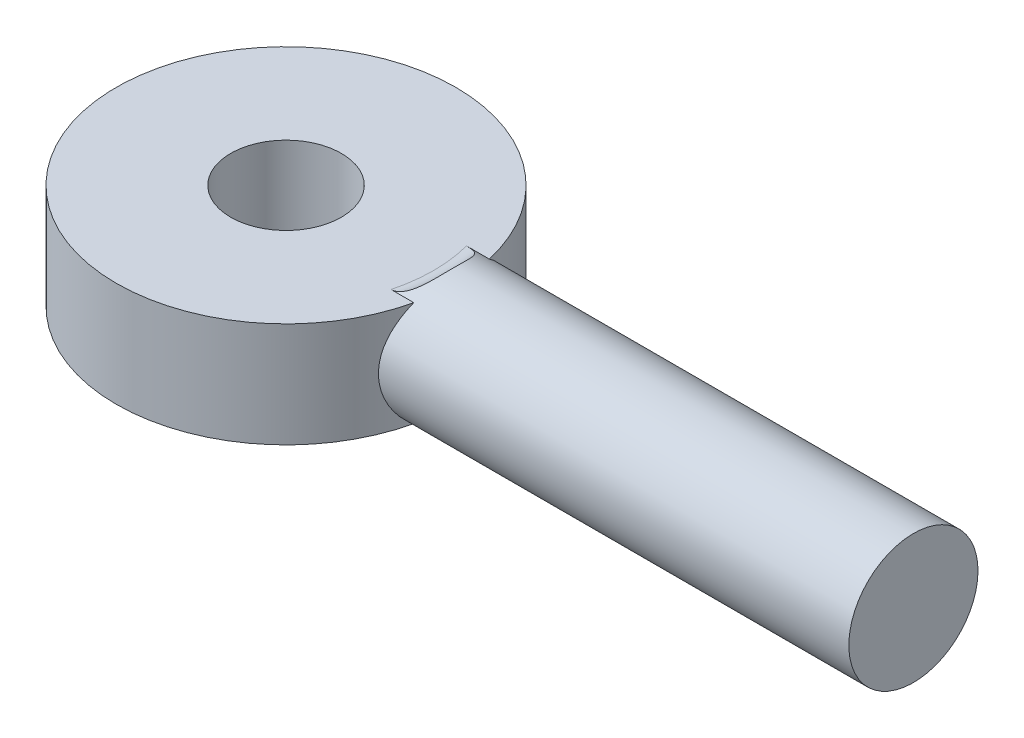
ISO-10303-21;
HEADER;
FILE_DESCRIPTION(('STEP AP214'),'2;1');
FILE_NAME('part.step','',(''),(''),'','','');
FILE_SCHEMA(('AUTOMOTIVE_DESIGN { 1 0 10303 214 1 1 1 1 }'));
ENDSEC;
DATA;
#1=APPLICATION_CONTEXT('core data for automotive mechanical design processes');
#2=APPLICATION_PROTOCOL_DEFINITION('international standard','automotive_design',2000,#1);
#3=PRODUCT_CONTEXT('',#1,'mechanical');
#4=PRODUCT('Part','Part','',(#3));
#5=PRODUCT_RELATED_PRODUCT_CATEGORY('part','',(#4));
#6=PRODUCT_DEFINITION_FORMATION('','',#4);
#7=PRODUCT_DEFINITION_CONTEXT('part definition',#1,'design');
#8=PRODUCT_DEFINITION('design','',#6,#7);
#9=PRODUCT_DEFINITION_SHAPE('','',#8);
#10=(LENGTH_UNIT() NAMED_UNIT(*) SI_UNIT(.MILLI.,.METRE.));
#11=(NAMED_UNIT(*) PLANE_ANGLE_UNIT() SI_UNIT($,.RADIAN.));
#12=(NAMED_UNIT(*) SI_UNIT($,.STERADIAN.) SOLID_ANGLE_UNIT());
#13=UNCERTAINTY_MEASURE_WITH_UNIT(LENGTH_MEASURE(1.E-05),#10,'distance_accuracy_value','');
#14=(GEOMETRIC_REPRESENTATION_CONTEXT(3) GLOBAL_UNCERTAINTY_ASSIGNED_CONTEXT((#13)) GLOBAL_UNIT_ASSIGNED_CONTEXT((#10,
#11,#12)) REPRESENTATION_CONTEXT('',''));
#15=CARTESIAN_POINT('',(0.,0.,0.));
#16=DIRECTION('',(0.,0.,1.));
#17=DIRECTION('',(1.,0.,0.));
#18=AXIS2_PLACEMENT_3D('',#15,#16,#17);
#19=CARTESIAN_POINT('',(0.,4.5085,0.));
#20=DIRECTION('',(0.,1.,0.));
#21=DIRECTION('',(0.,0.,1.));
#22=AXIS2_PLACEMENT_3D('',#19,#20,#21);
#23=PLANE('',#22);
#24=CARTESIAN_POINT('',(0.,4.5085,0.));
#25=DIRECTION('',(0.,1.,0.));
#26=DIRECTION('',(0.,0.,1.));
#27=AXIS2_PLACEMENT_3D('',#24,#25,#26);
#28=CIRCLE('',#27,12.7);
#29=CARTESIAN_POINT('',(12.2778116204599,4.5085,3.24735920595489));
#30=VERTEX_POINT('',#29);
#31=CARTESIAN_POINT('',(12.2778116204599,4.5085,-3.24735920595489));
#32=VERTEX_POINT('',#31);
#33=EDGE_CURVE('E89',#30,#32,#28,.T.);
#34=ORIENTED_EDGE('',*,*,#33,.T.);
#35=DIRECTION('',(1.,0.,0.));
#36=VECTOR('',#35,1.);
#37=CARTESIAN_POINT('',(12.2778116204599,4.5085,-3.24735920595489));
#38=LINE('',#37,#36);
#39=CARTESIAN_POINT('',(14.2394059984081,4.5085,-3.24735920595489));
#40=VERTEX_POINT('',#39);
#41=EDGE_CURVE('E91',#32,#40,#38,.T.);
#42=ORIENTED_EDGE('',*,*,#41,.T.);
#43=CARTESIAN_POINT('',(0.,4.5085,0.));
#44=DIRECTION('',(0.,1.,0.));
#45=DIRECTION('',(0.,0.,1.));
#46=AXIS2_PLACEMENT_3D('',#43,#44,#45);
#47=CIRCLE('',#46,14.605);
#48=CARTESIAN_POINT('',(14.2394059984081,4.5085,3.24735920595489));
#49=VERTEX_POINT('',#48);
#50=EDGE_CURVE('E207',#40,#49,#47,.T.);
#51=ORIENTED_EDGE('',*,*,#50,.T.);
#52=DIRECTION('',(1.,0.,0.));
#53=VECTOR('',#52,1.);
#54=CARTESIAN_POINT('',(14.2394059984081,4.5085,3.24735920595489));
#55=LINE('',#54,#53);
#56=EDGE_CURVE('E60',#49,#30,#55,.F.);
#57=ORIENTED_EDGE('',*,*,#56,.T.);
#58=EDGE_LOOP('',(#34,#42,#51,#57));
#59=FACE_BOUND('',#58,.T.);
#60=CARTESIAN_POINT('',(0.,4.5085,0.));
#61=DIRECTION('',(0.,1.,0.));
#62=DIRECTION('',(0.,0.,1.));
#63=AXIS2_PLACEMENT_3D('',#60,#61,#62);
#64=CIRCLE('',#63,4.7625);
#65=CARTESIAN_POINT('',(0.,4.5085,4.7625));
#66=VERTEX_POINT('',#65);
#67=EDGE_CURVE('E201',#66,#66,#64,.T.);
#68=ORIENTED_EDGE('',*,*,#67,.F.);
#69=EDGE_LOOP('',(#68));
#70=FACE_BOUND('',#69,.T.);
#71=ADVANCED_FACE('F39',(#59,#70),#23,.T.);
#72=CARTESIAN_POINT('',(0.,-4.5085,0.));
#73=DIRECTION('',(0.,1.,0.));
#74=DIRECTION('',(0.,0.,1.));
#75=AXIS2_PLACEMENT_3D('',#72,#73,#74);
#76=PLANE('',#75);
#77=CARTESIAN_POINT('',(0.,-4.5085,0.));
#78=DIRECTION('',(0.,1.,0.));
#79=DIRECTION('',(0.,0.,1.));
#80=AXIS2_PLACEMENT_3D('',#77,#78,#79);
#81=CIRCLE('',#80,14.605);
#82=CARTESIAN_POINT('',(14.2394059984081,-4.5085,-3.2473592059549));
#83=VERTEX_POINT('',#82);
#84=CARTESIAN_POINT('',(14.2394059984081,-4.5085,3.2473592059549));
#85=VERTEX_POINT('',#84);
#86=EDGE_CURVE('E205',#83,#85,#81,.T.);
#87=ORIENTED_EDGE('',*,*,#86,.F.);
#88=DIRECTION('',(1.,0.,0.));
#89=VECTOR('',#88,1.);
#90=CARTESIAN_POINT('',(14.2394059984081,-4.5085,-3.2473592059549));
#91=LINE('',#90,#89);
#92=CARTESIAN_POINT('',(12.2778116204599,-4.5085,-3.24735920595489));
#93=VERTEX_POINT('',#92);
#94=EDGE_CURVE('E100',#83,#93,#91,.F.);
#95=ORIENTED_EDGE('',*,*,#94,.T.);
#96=CARTESIAN_POINT('',(0.,-4.5085,0.));
#97=DIRECTION('',(0.,1.,0.));
#98=DIRECTION('',(0.,0.,1.));
#99=AXIS2_PLACEMENT_3D('',#96,#97,#98);
#100=CIRCLE('',#99,12.7);
#101=CARTESIAN_POINT('',(12.2778116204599,-4.5085,3.24735920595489));
#102=VERTEX_POINT('',#101);
#103=EDGE_CURVE('E212',#93,#102,#100,.F.);
#104=ORIENTED_EDGE('',*,*,#103,.T.);
#105=DIRECTION('',(1.,0.,0.));
#106=VECTOR('',#105,1.);
#107=CARTESIAN_POINT('',(12.2778116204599,-4.5085,3.24735920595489));
#108=LINE('',#107,#106);
#109=EDGE_CURVE('E81',#102,#85,#108,.T.);
#110=ORIENTED_EDGE('',*,*,#109,.T.);
#111=EDGE_LOOP('',(#87,#95,#104,#110));
#112=FACE_BOUND('',#111,.T.);
#113=CARTESIAN_POINT('',(0.,-4.5085,0.));
#114=DIRECTION('',(0.,1.,0.));
#115=DIRECTION('',(0.,0.,1.));
#116=AXIS2_PLACEMENT_3D('',#113,#114,#115);
#117=CIRCLE('',#116,4.7625);
#118=CARTESIAN_POINT('',(0.,-4.5085,4.7625));
#119=VERTEX_POINT('',#118);
#120=EDGE_CURVE('E198',#119,#119,#117,.T.);
#121=ORIENTED_EDGE('',*,*,#120,.T.);
#122=EDGE_LOOP('',(#121));
#123=FACE_BOUND('',#122,.T.);
#124=ADVANCED_FACE('F136',(#112,#123),#76,.F.);
#125=CARTESIAN_POINT('',(0.,4.5085,0.));
#126=DIRECTION('',(0.,-1.,0.));
#127=DIRECTION('',(0.,0.,-1.));
#128=AXIS2_PLACEMENT_3D('',#125,#126,#127);
#129=CYLINDRICAL_SURFACE('',#128,14.605);
#130=ORIENTED_EDGE('',*,*,#50,.F.);
#131=CARTESIAN_POINT('',(14.2394059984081,4.5085,-3.24735920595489));
#132=CARTESIAN_POINT('',(14.2101779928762,4.41617265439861,-3.37555538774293));
#133=CARTESIAN_POINT('',(14.1800463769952,4.3184705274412,-3.49966034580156));
#134=CARTESIAN_POINT('',(14.1188259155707,4.11300201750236,-3.73898089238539));
#135=CARTESIAN_POINT('',(14.0877370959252,4.00523590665,-3.85419672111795));
#136=CARTESIAN_POINT('',(14.025397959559,3.78012978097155,-4.0752255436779));
#137=CARTESIAN_POINT('',(13.9941474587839,3.66277390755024,-4.18102233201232));
#138=CARTESIAN_POINT('',(13.9324078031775,3.41931935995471,-4.38236550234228));
#139=CARTESIAN_POINT('',(13.9019188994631,3.29321785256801,-4.47790853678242));
#140=CARTESIAN_POINT('',(13.8425753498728,3.03295930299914,-4.65812664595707));
#141=CARTESIAN_POINT('',(13.8137219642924,2.89879620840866,-4.74279340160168));
#142=CARTESIAN_POINT('',(13.7585519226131,2.6233268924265,-4.90053655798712));
#143=CARTESIAN_POINT('',(13.7322351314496,2.48202105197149,-4.9736135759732));
#144=CARTESIAN_POINT('',(13.6829960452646,2.19328179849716,-5.10751728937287));
#145=CARTESIAN_POINT('',(13.6600711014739,2.04585328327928,-5.16835355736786));
#146=CARTESIAN_POINT('',(13.6183717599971,1.74584834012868,-5.27725102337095));
#147=CARTESIAN_POINT('',(13.5995955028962,1.59327425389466,-5.3253179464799));
#148=CARTESIAN_POINT('',(13.5673855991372,1.28916295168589,-5.40684119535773));
#149=CARTESIAN_POINT('',(13.5537962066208,1.13775742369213,-5.4407270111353));
#150=CARTESIAN_POINT('',(13.5315829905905,0.832349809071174,-5.49574105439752));
#151=CARTESIAN_POINT('',(13.5229569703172,0.678348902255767,-5.51687492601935));
#152=CARTESIAN_POINT('',(13.5109694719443,0.368902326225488,-5.54616810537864));
#153=CARTESIAN_POINT('',(13.5076083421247,0.213456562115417,-5.55432655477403));
#154=CARTESIAN_POINT('',(13.5062745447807,-0.0975908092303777,-5.55756938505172));
#155=CARTESIAN_POINT('',(13.5083016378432,-0.253192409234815,-5.5526543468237));
#156=CARTESIAN_POINT('',(13.517371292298,-0.553435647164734,-5.53053581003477));
#157=CARTESIAN_POINT('',(13.5240877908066,-0.69814680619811,-5.51413099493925));
#158=CARTESIAN_POINT('',(13.5419701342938,-0.985613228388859,-5.47006712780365));
#159=CARTESIAN_POINT('',(13.5531374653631,-1.12836782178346,-5.44240431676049));
#160=CARTESIAN_POINT('',(13.5795770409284,-1.41087472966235,-5.3760938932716));
#161=CARTESIAN_POINT('',(13.5948481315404,-1.550627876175,-5.33744936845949));
#162=CARTESIAN_POINT('',(13.6290407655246,-1.82630608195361,-5.24952249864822));
#163=CARTESIAN_POINT('',(13.6479636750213,-1.96222968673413,-5.20023617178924));
#164=CARTESIAN_POINT('',(13.7100834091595,-2.36727543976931,-5.03524317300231));
#165=CARTESIAN_POINT('',(13.7581963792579,-2.62928423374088,-4.9034368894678));
#166=CARTESIAN_POINT('',(13.8621677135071,-3.12815173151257,-4.60127706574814));
#167=CARTESIAN_POINT('',(13.9180265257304,-3.36500897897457,-4.43092129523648));
#168=CARTESIAN_POINT('',(14.0194493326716,-3.76017842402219,-4.09688149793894));
#169=CARTESIAN_POINT('',(14.0645867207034,-3.924328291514,-3.93991698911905));
#170=CARTESIAN_POINT('',(14.1535739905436,-4.23215076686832,-3.60723516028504));
#171=CARTESIAN_POINT('',(14.1974258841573,-4.37585689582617,-3.43154938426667));
#172=CARTESIAN_POINT('',(14.2394059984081,-4.5085,-3.24735920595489));
#173=B_SPLINE_CURVE_WITH_KNOTS('',3,(#131,#132,#133,#134,#135,#136,#137,#138,#139,#140,#141,
#142,#143,#144,#145,#146,#147,#148,#149,#150,#151,#152,#153,#154,#155,#156,#157,#158,#159,#160,
#161,#162,#163,#164,#165,#166,#167,#168,#169,#170,#171,#172),.UNSPECIFIED.,.F.,.F.,(4,2,2,2,2,2,
2,2,2,2,2,2,2,2,2,2,2,2,2,2,4),(0.,0.481832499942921,0.963651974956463,1.44628501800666,
1.92907515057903,2.41223239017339,2.89536388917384,3.37811608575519,3.86065147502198,
4.32727647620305,4.79369479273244,5.26014396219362,5.72657240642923,6.16343511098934,
6.60044380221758,7.03732974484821,7.47437944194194,8.36190718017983,9.24948628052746,
9.94255240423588,10.634468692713),.UNSPECIFIED.);
#174=EDGE_CURVE('E94',#40,#83,#173,.T.);
#175=ORIENTED_EDGE('',*,*,#174,.T.);
#176=ORIENTED_EDGE('',*,*,#86,.T.);
#177=CARTESIAN_POINT('',(14.2394059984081,-4.5085,3.24735920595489));
#178=CARTESIAN_POINT('',(14.2101779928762,-4.41617265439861,3.37555538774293));
#179=CARTESIAN_POINT('',(14.1800463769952,-4.3184705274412,3.49966034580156));
#180=CARTESIAN_POINT('',(14.1188259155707,-4.11300201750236,3.73898089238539));
#181=CARTESIAN_POINT('',(14.0877370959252,-4.00523590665,3.85419672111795));
#182=CARTESIAN_POINT('',(14.025397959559,-3.78012978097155,4.0752255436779));
#183=CARTESIAN_POINT('',(13.9941474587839,-3.66277390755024,4.18102233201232));
#184=CARTESIAN_POINT('',(13.9324078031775,-3.41931935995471,4.38236550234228));
#185=CARTESIAN_POINT('',(13.9019188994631,-3.29321785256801,4.47790853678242));
#186=CARTESIAN_POINT('',(13.8425753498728,-3.03295930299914,4.65812664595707));
#187=CARTESIAN_POINT('',(13.8137219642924,-2.89879620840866,4.74279340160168));
#188=CARTESIAN_POINT('',(13.7585519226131,-2.6233268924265,4.90053655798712));
#189=CARTESIAN_POINT('',(13.7322351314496,-2.48202105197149,4.9736135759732));
#190=CARTESIAN_POINT('',(13.6829960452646,-2.19328179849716,5.10751728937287));
#191=CARTESIAN_POINT('',(13.6600711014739,-2.04585328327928,5.16835355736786));
#192=CARTESIAN_POINT('',(13.6183717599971,-1.74584834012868,5.27725102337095));
#193=CARTESIAN_POINT('',(13.5995955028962,-1.59327425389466,5.3253179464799));
#194=CARTESIAN_POINT('',(13.5673855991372,-1.28916295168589,5.40684119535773));
#195=CARTESIAN_POINT('',(13.5537962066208,-1.13775742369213,5.4407270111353));
#196=CARTESIAN_POINT('',(13.5315829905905,-0.832349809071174,5.49574105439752));
#197=CARTESIAN_POINT('',(13.5229569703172,-0.678348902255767,5.51687492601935));
#198=CARTESIAN_POINT('',(13.5109694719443,-0.368902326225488,5.54616810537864));
#199=CARTESIAN_POINT('',(13.5076083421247,-0.213456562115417,5.55432655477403));
#200=CARTESIAN_POINT('',(13.5062745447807,0.0975908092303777,5.55756938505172));
#201=CARTESIAN_POINT('',(13.5083016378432,0.253192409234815,5.5526543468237));
#202=CARTESIAN_POINT('',(13.517371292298,0.553435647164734,5.53053581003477));
#203=CARTESIAN_POINT('',(13.5240877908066,0.69814680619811,5.51413099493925));
#204=CARTESIAN_POINT('',(13.5419701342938,0.985613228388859,5.47006712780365));
#205=CARTESIAN_POINT('',(13.5531374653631,1.12836782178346,5.44240431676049));
#206=CARTESIAN_POINT('',(13.5795770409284,1.41087472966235,5.3760938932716));
#207=CARTESIAN_POINT('',(13.5948481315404,1.550627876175,5.33744936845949));
#208=CARTESIAN_POINT('',(13.6290407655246,1.82630608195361,5.24952249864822));
#209=CARTESIAN_POINT('',(13.6479636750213,1.96222968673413,5.20023617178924));
#210=CARTESIAN_POINT('',(13.7100834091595,2.36727543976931,5.03524317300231));
#211=CARTESIAN_POINT('',(13.7581963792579,2.62928423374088,4.9034368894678));
#212=CARTESIAN_POINT('',(13.8621677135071,3.12815173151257,4.60127706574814));
#213=CARTESIAN_POINT('',(13.9180265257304,3.36500897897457,4.43092129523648));
#214=CARTESIAN_POINT('',(14.0194493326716,3.76017842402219,4.09688149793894));
#215=CARTESIAN_POINT('',(14.0645867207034,3.924328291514,3.93991698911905));
#216=CARTESIAN_POINT('',(14.1535739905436,4.23215076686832,3.60723516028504));
#217=CARTESIAN_POINT('',(14.1974258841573,4.37585689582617,3.43154938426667));
#218=CARTESIAN_POINT('',(14.2394059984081,4.5085,3.24735920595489));
#219=B_SPLINE_CURVE_WITH_KNOTS('',3,(#177,#178,#179,#180,#181,#182,#183,#184,#185,#186,#187,
#188,#189,#190,#191,#192,#193,#194,#195,#196,#197,#198,#199,#200,#201,#202,#203,#204,#205,#206,
#207,#208,#209,#210,#211,#212,#213,#214,#215,#216,#217,#218),.UNSPECIFIED.,.F.,.F.,(4,2,2,2,2,2,
2,2,2,2,2,2,2,2,2,2,2,2,2,2,4),(0.,0.481832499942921,0.963651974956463,1.44628501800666,
1.92907515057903,2.41223239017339,2.89536388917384,3.37811608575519,3.86065147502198,
4.32727647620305,4.79369479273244,5.26014396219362,5.72657240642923,6.16343511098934,
6.60044380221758,7.03732974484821,7.47437944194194,8.36190718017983,9.24948628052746,
9.94255240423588,10.634468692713),.UNSPECIFIED.);
#220=EDGE_CURVE('E121',#85,#49,#219,.T.);
#221=ORIENTED_EDGE('',*,*,#220,.T.);
#222=EDGE_LOOP('',(#130,#175,#176,#221));
#223=FACE_BOUND('',#222,.T.);
#224=ADVANCED_FACE('F132',(#223),#129,.T.);
#225=CARTESIAN_POINT('',(0.,4.5085,0.));
#226=DIRECTION('',(0.,-1.,0.));
#227=DIRECTION('',(0.,0.,-1.));
#228=AXIS2_PLACEMENT_3D('',#225,#226,#227);
#229=CYLINDRICAL_SURFACE('',#228,4.7625);
#230=ORIENTED_EDGE('',*,*,#67,.T.);
#231=EDGE_LOOP('',(#230));
#232=FACE_BOUND('',#231,.T.);
#233=ORIENTED_EDGE('',*,*,#120,.F.);
#234=EDGE_LOOP('',(#233));
#235=FACE_BOUND('',#234,.T.);
#236=ADVANCED_FACE('F115',(#232,#235),#229,.F.);
#237=CARTESIAN_POINT('',(53.975,0.,0.));
#238=DIRECTION('',(1.,0.,0.));
#239=DIRECTION('',(0.,0.,-1.));
#240=AXIS2_PLACEMENT_3D('',#237,#238,#239);
#241=PLANE('',#240);
#242=CARTESIAN_POINT('',(53.975,0.,0.));
#243=DIRECTION('',(1.,0.,0.));
#244=DIRECTION('',(0.,0.,-1.));
#245=AXIS2_PLACEMENT_3D('',#242,#243,#244);
#246=CIRCLE('',#245,5.55625);
#247=CARTESIAN_POINT('',(53.975,0.,-5.55625));
#248=VERTEX_POINT('',#247);
#249=EDGE_CURVE('E197',#248,#248,#246,.T.);
#250=ORIENTED_EDGE('',*,*,#249,.T.);
#251=EDGE_LOOP('',(#250));
#252=FACE_BOUND('',#251,.T.);
#253=ADVANCED_FACE('F113',(#252),#241,.T.);
#254=CARTESIAN_POINT('',(-14.606,0.,0.));
#255=DIRECTION('',(1.,0.,0.));
#256=DIRECTION('',(0.,0.,-1.));
#257=AXIS2_PLACEMENT_3D('',#254,#255,#256);
#258=CYLINDRICAL_SURFACE('',#257,5.55625);
#259=ORIENTED_EDGE('',*,*,#249,.F.);
#260=EDGE_LOOP('',(#259));
#261=FACE_BOUND('',#260,.T.);
#262=ORIENTED_EDGE('',*,*,#41,.F.);
#263=CARTESIAN_POINT('',(12.2778116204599,4.5085,-3.24735920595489));
#264=CARTESIAN_POINT('',(12.3217319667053,4.50849621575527,-3.24735655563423));
#265=CARTESIAN_POINT('',(12.3655952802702,4.50991977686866,-3.24538873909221));
#266=CARTESIAN_POINT('',(12.4527658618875,4.51536873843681,-3.23780672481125));
#267=CARTESIAN_POINT('',(12.4960740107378,4.51938930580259,-3.23219930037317));
#268=CARTESIAN_POINT('',(12.6238182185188,4.53486436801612,-3.21048861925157));
#269=CARTESIAN_POINT('',(12.7070417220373,4.54974351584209,-3.18948398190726));
#270=CARTESIAN_POINT('',(12.8674616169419,4.58638446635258,-3.13655917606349));
#271=CARTESIAN_POINT('',(12.9446970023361,4.6080960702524,-3.10471848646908));
#272=CARTESIAN_POINT('',(13.0931223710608,4.65652157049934,-3.03160910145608));
#273=CARTESIAN_POINT('',(13.1642926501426,4.68325093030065,-2.99031117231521));
#274=CARTESIAN_POINT('',(13.3334432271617,4.75392411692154,-2.87723124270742));
#275=CARTESIAN_POINT('',(13.4272766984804,4.79984412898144,-2.80047372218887));
#276=CARTESIAN_POINT('',(13.5997132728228,4.89390559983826,-2.63265359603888));
#277=CARTESIAN_POINT('',(13.6782990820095,4.94204950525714,-2.54157495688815));
#278=CARTESIAN_POINT('',(13.7970649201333,5.02091783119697,-2.38064090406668));
#279=CARTESIAN_POINT('',(13.8412877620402,5.052070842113,-2.31390770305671));
#280=CARTESIAN_POINT('',(13.9237492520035,5.11290821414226,-2.17617659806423));
#281=CARTESIAN_POINT('',(13.961986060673,5.14259212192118,-2.10517739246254));
#282=CARTESIAN_POINT('',(14.032897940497,5.19984094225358,-1.95951627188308));
#283=CARTESIAN_POINT('',(14.0655651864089,5.22740284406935,-1.88484939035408));
#284=CARTESIAN_POINT('',(14.1256895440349,5.27984357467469,-1.73252934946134));
#285=CARTESIAN_POINT('',(14.1531455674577,5.30472184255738,-1.65487557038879));
#286=CARTESIAN_POINT('',(14.2097756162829,5.35747683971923,-1.47651923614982));
#287=CARTESIAN_POINT('',(14.2375264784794,5.3844404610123,-1.37509250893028));
#288=CARTESIAN_POINT('',(14.2860622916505,5.43285157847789,-1.16928348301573));
#289=CARTESIAN_POINT('',(14.3068449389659,5.45429724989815,-1.06490021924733));
#290=CARTESIAN_POINT('',(14.3419888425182,5.49124357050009,-0.85416007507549));
#291=CARTESIAN_POINT('',(14.3563576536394,5.50675121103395,-0.747805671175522));
#292=CARTESIAN_POINT('',(14.3791265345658,5.53159831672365,-0.533793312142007));
#293=CARTESIAN_POINT('',(14.3875289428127,5.54094019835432,-0.426135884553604));
#294=CARTESIAN_POINT('',(14.3982492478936,5.55290325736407,-0.217562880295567));
#295=CARTESIAN_POINT('',(14.4009441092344,5.55594052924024,-0.116689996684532));
#296=CARTESIAN_POINT('',(14.4014547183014,5.55651455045,0.085093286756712));
#297=CARTESIAN_POINT('',(14.3992699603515,5.55405072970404,0.186003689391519));
#298=CARTESIAN_POINT('',(14.3894357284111,5.54306086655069,0.398718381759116));
#299=CARTESIAN_POINT('',(14.3811956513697,5.53388016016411,0.510462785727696));
#300=CARTESIAN_POINT('',(14.3583224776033,5.50887537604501,0.732600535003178));
#301=CARTESIAN_POINT('',(14.3436865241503,5.49304832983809,0.84299325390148));
#302=CARTESIAN_POINT('',(14.3075388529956,5.45500799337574,1.06166393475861));
#303=CARTESIAN_POINT('',(14.2860197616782,5.4327878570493,1.16993949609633));
#304=CARTESIAN_POINT('',(14.2354759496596,5.38241743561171,1.38329193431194));
#305=CARTESIAN_POINT('',(14.2064542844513,5.35426956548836,1.488370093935));
#306=CARTESIAN_POINT('',(14.1483929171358,5.30039483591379,1.66860543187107));
#307=CARTESIAN_POINT('',(14.1211610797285,5.27581354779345,1.74469178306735));
#308=CARTESIAN_POINT('',(14.0616554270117,5.22408534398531,1.89395899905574));
#309=CARTESIAN_POINT('',(14.0293827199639,5.19693899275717,1.96714049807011));
#310=CARTESIAN_POINT('',(13.9594608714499,5.14062318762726,2.10992516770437));
#311=CARTESIAN_POINT('',(13.921820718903,5.11145715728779,2.17953406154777));
#312=CARTESIAN_POINT('',(13.8407680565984,5.05171649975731,2.31463521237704));
#313=CARTESIAN_POINT('',(13.7973571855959,5.02114227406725,2.38012863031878));
#314=CARTESIAN_POINT('',(13.6811006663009,4.94386521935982,2.53794921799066));
#315=CARTESIAN_POINT('',(13.6043975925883,4.89674913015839,2.62729988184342));
#316=CARTESIAN_POINT('',(13.4363284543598,4.80451670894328,2.79239543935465));
#317=CARTESIAN_POINT('',(13.3449674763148,4.75939969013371,2.86814503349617));
#318=CARTESIAN_POINT('',(13.1716886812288,4.68591961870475,2.98625074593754));
#319=CARTESIAN_POINT('',(13.0928608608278,4.65614797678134,3.03224952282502));
#320=CARTESIAN_POINT('',(12.9277438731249,4.60288390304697,3.11250311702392));
#321=CARTESIAN_POINT('',(12.84148473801,4.57936763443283,3.14680266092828));
#322=CARTESIAN_POINT('',(12.6766841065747,4.54421188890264,3.19732559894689));
#323=CARTESIAN_POINT('',(12.5990448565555,4.53129027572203,3.21553683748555));
#324=CARTESIAN_POINT('',(12.440368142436,4.51337915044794,3.24059273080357));
#325=CARTESIAN_POINT('',(12.3593056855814,4.50846496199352,3.24732947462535));
#326=CARTESIAN_POINT('',(12.2778116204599,4.50849999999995,3.24735920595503));
#327=B_SPLINE_CURVE_WITH_KNOTS('',3,(#263,#264,#265,#266,#267,#268,#269,#270,#271,#272,#273,
#274,#275,#276,#277,#278,#279,#280,#281,#282,#283,#284,#285,#286,#287,#288,#289,#290,#291,#292,
#293,#294,#295,#296,#297,#298,#299,#300,#301,#302,#303,#304,#305,#306,#307,#308,#309,#310,#311,
#312,#313,#314,#315,#316,#317,#318,#319,#320,#321,#322,#323,#324,#325,#326),.UNSPECIFIED.,.F.,
.F.,(4,2,2,2,2,2,2,2,2,2,2,2,2,2,2,2,2,2,2,2,2,2,2,2,2,2,2,2,2,2,2,4),(0.,0.131601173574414,
0.262958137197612,0.522818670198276,0.780812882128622,1.03961562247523,1.42640281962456,
1.81362617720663,2.0710257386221,2.32850423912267,2.58634156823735,2.84423268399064,
3.16945852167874,3.49479177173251,3.81974079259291,4.14456238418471,4.44715991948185,
4.74978881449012,5.08667488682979,5.42371158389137,5.76111055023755,6.09837232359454,
6.35156271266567,6.6046975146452,6.85741326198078,7.11005739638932,7.48915436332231,
7.8681200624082,8.15510655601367,8.44098325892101,8.6821591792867,8.92559094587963),.UNSPECIFIED.);
#328=EDGE_CURVE('E12',#32,#30,#327,.T.);
#329=ORIENTED_EDGE('',*,*,#328,.T.);
#330=ORIENTED_EDGE('',*,*,#56,.F.);
#331=ORIENTED_EDGE('',*,*,#220,.F.);
#332=ORIENTED_EDGE('',*,*,#109,.F.);
#333=CARTESIAN_POINT('',(12.2778116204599,-4.5085,3.24735920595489));
#334=CARTESIAN_POINT('',(12.3217311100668,-4.50849621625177,3.24735655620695));
#335=CARTESIAN_POINT('',(12.3655935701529,-4.50991972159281,3.24538881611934));
#336=CARTESIAN_POINT('',(12.4527624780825,-4.51536847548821,3.23780709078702));
#337=CARTESIAN_POINT('',(12.4960698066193,-4.51938889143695,3.23219987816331));
#338=CARTESIAN_POINT('',(12.6238149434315,-4.53486378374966,3.21048944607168));
#339=CARTESIAN_POINT('',(12.7070401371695,-4.54974315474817,3.18948450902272));
#340=CARTESIAN_POINT('',(12.8674635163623,-4.58638489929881,3.13655854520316));
#341=CARTESIAN_POINT('',(12.9447006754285,-4.60809710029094,3.10471695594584));
#342=CARTESIAN_POINT('',(13.0931257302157,-4.65652283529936,3.03160716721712));
#343=CARTESIAN_POINT('',(13.1642942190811,-4.68325159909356,2.99031017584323));
#344=CARTESIAN_POINT('',(13.3334340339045,-4.75392025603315,2.87723731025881));
#345=CARTESIAN_POINT('',(13.4272598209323,-4.7998357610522,2.80048720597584));
#346=CARTESIAN_POINT('',(13.5996986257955,-4.89389676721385,2.63267080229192));
#347=CARTESIAN_POINT('',(13.6782915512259,-4.94204511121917,2.54158587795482));
#348=CARTESIAN_POINT('',(13.7970850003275,-5.02093076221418,2.38061321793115));
#349=CARTESIAN_POINT('',(13.8413260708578,-5.05209646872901,2.3138487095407));
#350=CARTESIAN_POINT('',(13.9238128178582,-5.11295775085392,2.17606542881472));
#351=CARTESIAN_POINT('',(13.9620565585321,-5.14265284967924,2.10504529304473));
#352=CARTESIAN_POINT('',(14.0683993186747,-5.22849441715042,1.8865669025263));
#353=CARTESIAN_POINT('',(14.1281169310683,-5.28140213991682,1.73368074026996));
#354=CARTESIAN_POINT('',(14.2305419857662,-5.37682610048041,1.41113909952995));
#355=CARTESIAN_POINT('',(14.2723524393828,-5.41876040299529,1.24103720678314));
#356=CARTESIAN_POINT('',(14.3380009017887,-5.4866557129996,0.894274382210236));
#357=CARTESIAN_POINT('',(14.3618343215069,-5.51261264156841,0.717611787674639));
#358=CARTESIAN_POINT('',(14.3878145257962,-5.54123043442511,0.424387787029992));
#359=CARTESIAN_POINT('',(14.3946503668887,-5.54888395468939,0.308671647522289));
#360=CARTESIAN_POINT('',(14.4018321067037,-5.55693031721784,0.0767444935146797));
#361=CARTESIAN_POINT('',(14.402176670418,-5.55732166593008,-0.0394666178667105));
#362=CARTESIAN_POINT('',(14.3963820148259,-5.55082105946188,-0.271694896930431));
#363=CARTESIAN_POINT('',(14.3902330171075,-5.54391812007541,-0.387711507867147));
#364=CARTESIAN_POINT('',(14.3712180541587,-5.52292986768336,-0.618534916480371));
#365=CARTESIAN_POINT('',(14.3583526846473,-5.50884519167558,-0.733341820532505));
#366=CARTESIAN_POINT('',(14.3254742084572,-5.47375937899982,-0.960781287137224));
#367=CARTESIAN_POINT('',(14.3054661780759,-5.4527631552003,-1.07341533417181));
#368=CARTESIAN_POINT('',(14.2576464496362,-5.40427600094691,-1.29562603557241));
#369=CARTESIAN_POINT('',(14.2298332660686,-5.37678383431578,-1.40520210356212));
#370=CARTESIAN_POINT('',(14.1656505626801,-5.31603975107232,-1.61988965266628));
#371=CARTESIAN_POINT('',(14.1293020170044,-5.28280200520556,-1.72501134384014));
#372=CARTESIAN_POINT('',(14.0470915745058,-5.21152059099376,-1.92969103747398));
#373=CARTESIAN_POINT('',(14.0012363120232,-5.17348028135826,-2.02925285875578));
#374=CARTESIAN_POINT('',(13.887713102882,-5.0851581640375,-2.24257362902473));
#375=CARTESIAN_POINT('',(13.8174656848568,-5.03402458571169,-2.35463578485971));
#376=CARTESIAN_POINT('',(13.6596462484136,-4.9301699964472,-2.56496609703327));
#377=CARTESIAN_POINT('',(13.5721001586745,-4.87745146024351,-2.66325452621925));
#378=CARTESIAN_POINT('',(13.4010970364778,-4.7872355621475,-2.8214534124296));
#379=CARTESIAN_POINT('',(13.3213680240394,-4.74903548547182,-2.88498420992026));
#380=CARTESIAN_POINT('',(13.1511591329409,-4.67761483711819,-2.99939510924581));
#381=CARTESIAN_POINT('',(13.0606865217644,-4.64439093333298,-3.05028369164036));
#382=CARTESIAN_POINT('',(12.8940823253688,-4.59379747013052,-3.12577437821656));
#383=CARTESIAN_POINT('',(12.820058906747,-4.57454182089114,-3.15376854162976));
#384=CARTESIAN_POINT('',(12.6677058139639,-4.54257921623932,-3.19963686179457));
#385=CARTESIAN_POINT('',(12.5893909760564,-4.52985110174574,-3.21754373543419));
#386=CARTESIAN_POINT('',(12.4715822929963,-4.51710735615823,-3.23538301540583));
#387=CARTESIAN_POINT('',(12.4330743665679,-4.51392287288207,-3.23982017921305));
#388=CARTESIAN_POINT('',(12.3556617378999,-4.50961651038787,-3.24580956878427));
#389=CARTESIAN_POINT('',(12.3167565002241,-4.50849793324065,-3.24735717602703));
#390=CARTESIAN_POINT('',(12.2778116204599,-4.5085,-3.2473592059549));
#391=B_SPLINE_CURVE_WITH_KNOTS('',3,(#333,#334,#335,#336,#337,#338,#339,#340,#341,#342,#343,
#344,#345,#346,#347,#348,#349,#350,#351,#352,#353,#354,#355,#356,#357,#358,#359,#360,#361,#362,
#363,#364,#365,#366,#367,#368,#369,#370,#371,#372,#373,#374,#375,#376,#377,#378,#379,#380,#381,
#382,#383,#384,#385,#386,#387,#388,#389,#390),.UNSPECIFIED.,.F.,.F.,(4,2,2,2,2,2,2,2,2,2,2,2,2,
2,2,2,2,2,2,2,2,2,2,2,2,2,2,2,4),(0.,0.131598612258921,0.262953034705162,0.522818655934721,
0.780818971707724,1.03961560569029,1.42636753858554,1.81362618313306,2.07113101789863,
2.32871879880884,2.84385538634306,3.38241681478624,3.9211156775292,4.26926085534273,
4.61747763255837,4.96621952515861,5.31493049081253,5.66339411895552,6.01192411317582,
6.35960645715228,6.70704697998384,7.13094048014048,7.55420336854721,7.87968036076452,
8.20493842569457,8.44847410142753,8.69121528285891,8.80775096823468,8.92447275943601),.UNSPECIFIED.);
#392=EDGE_CURVE('E53',#102,#93,#391,.T.);
#393=ORIENTED_EDGE('',*,*,#392,.T.);
#394=ORIENTED_EDGE('',*,*,#94,.F.);
#395=ORIENTED_EDGE('',*,*,#174,.F.);
#396=EDGE_LOOP('',(#262,#329,#330,#331,#332,#393,#394,#395));
#397=FACE_BOUND('',#396,.T.);
#398=ADVANCED_FACE('F92',(#261,#397),#258,.T.);
#399=CARTESIAN_POINT('',(0.,-6.4135,0.));
#400=DIRECTION('',(0.,1.,0.));
#401=DIRECTION('',(0.,0.,1.));
#402=AXIS2_PLACEMENT_3D('',#399,#400,#401);
#403=TOROIDAL_SURFACE('',#402,12.7,1.905);
#404=ORIENTED_EDGE('',*,*,#392,.F.);
#405=ORIENTED_EDGE('',*,*,#103,.F.);
#406=EDGE_LOOP('',(#404,#405));
#407=FACE_BOUND('',#406,.T.);
#408=ADVANCED_FACE('F106',(#407),#403,.F.);
#409=CARTESIAN_POINT('',(0.,6.4135,0.));
#410=DIRECTION('',(0.,1.,0.));
#411=DIRECTION('',(0.,0.,1.));
#412=AXIS2_PLACEMENT_3D('',#409,#410,#411);
#413=TOROIDAL_SURFACE('',#412,12.7,1.905);
#414=ORIENTED_EDGE('',*,*,#33,.F.);
#415=ORIENTED_EDGE('',*,*,#328,.F.);
#416=EDGE_LOOP('',(#414,#415));
#417=FACE_BOUND('',#416,.T.);
#418=ADVANCED_FACE('F41',(#417),#413,.F.);
#419=CLOSED_SHELL('',(#71,#124,#224,#236,#253,#398,#408,#418));
#420=MANIFOLD_SOLID_BREP('B2',#419);
#421=ADVANCED_BREP_SHAPE_REPRESENTATION('',(#18,#420),#14);
#422=SHAPE_DEFINITION_REPRESENTATION(#9,#421);
ENDSEC;
END-ISO-10303-21;
